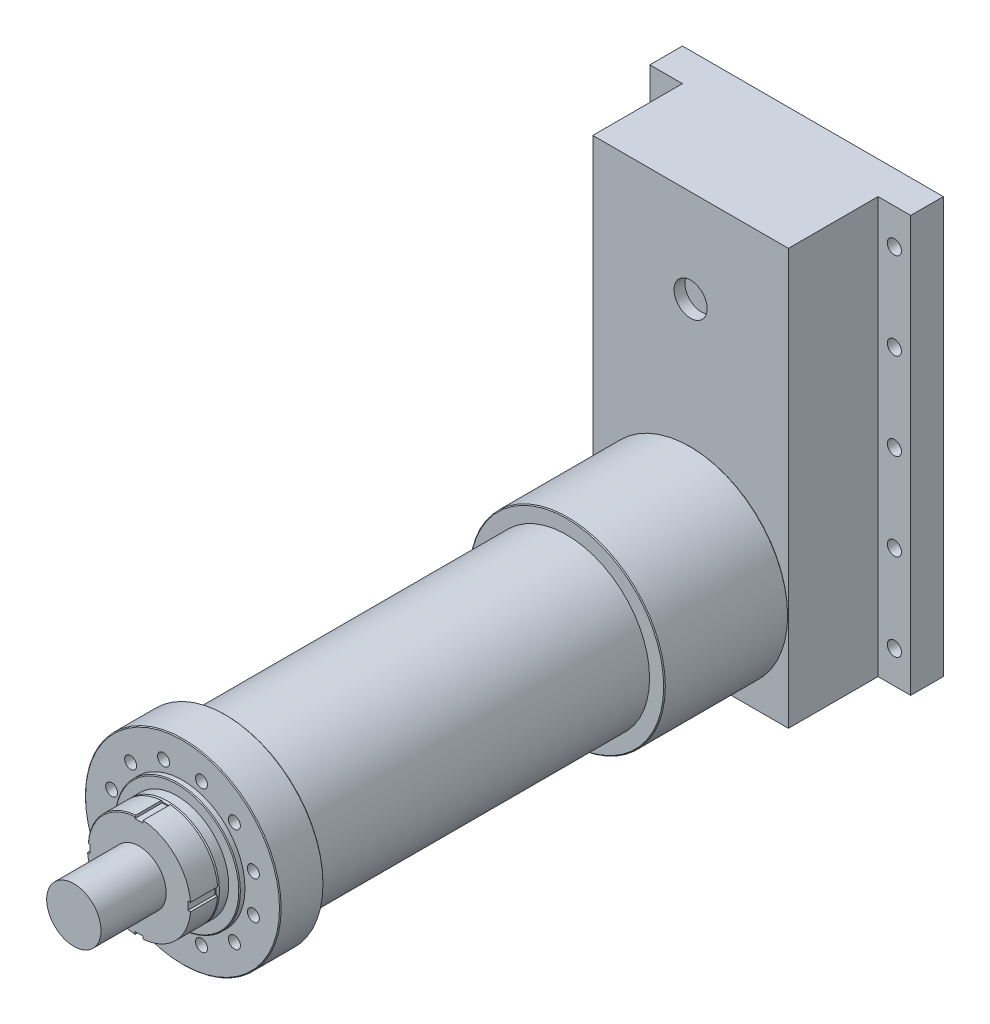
from build123d import *

# Parameters (mm, degrees)
SKETCH_1_R          = 152.5
EXTRUDE_1_DEPTH     = 627
SKETCH_2_R          = 180
SKETCH_2_R_2        = 11
EXTRUDE_2_DEPTH     = 80
SKETCH_3_R          = 115
EXTRUDE_3_DEPTH     = 10
SKETCH_4_R          = 95
EXTRUDE_4_DEPTH     = 20
CHAMFER_1_SIZE      = 3
EXTRUDE_5_DEPTH     = 50
CHAMFER_2_SIZE      = 1.5
EXTRUDE_START       = 228
SKETCH_11_R         = 180
EXTRUDE_10_DEPTH    = 228
CHAMFER_5_SIZE      = 1.5
EXTRUDE_11_DEPTH    = 165
SKETCH_16_R         = 16
CUT_EXTRUDE_4_DEPTH = 2
SKETCH_18_R         = 30.440746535
CUT_EXTRUDE_6_DEPTH = 20
SKETCH_19_R         = 50
EXTRUDE_12_DEPTH    = 120
SKETCH_23_W         = 480
SKETCH_23_H         = 765
SKETCH_23_R         = 13
EXTRUDE_16_DEPTH    = 60


with BuildPart() as part:
    # Sketch 1 → Extrude 1 (new body)
    with BuildSketch(Plane.XY):
        Circle(SKETCH_1_R)
    extrude(amount=EXTRUDE_1_DEPTH)

    # Sketch 2 → Extrude 2 (add)
    with BuildSketch(Plane.XY.offset(627)):
        Circle(SKETCH_2_R)
        with Locations((130.399986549, 34.940571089)):
            Circle(SKETCH_2_R_2, mode=Mode.SUBTRACT)
        with Locations((130.399986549, -34.940571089)):
            Circle(SKETCH_2_R_2, mode=Mode.SUBTRACT)
        with Locations((95.45941546, -95.45941546)):
            Circle(SKETCH_2_R_2, mode=Mode.SUBTRACT)
        with Locations((34.940571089, -130.399986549)):
            Circle(SKETCH_2_R_2, mode=Mode.SUBTRACT)
        with Locations((-34.940571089, -130.399986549)):
            Circle(SKETCH_2_R_2, mode=Mode.SUBTRACT)
        with Locations((-95.45941546, -95.45941546)):
            Circle(SKETCH_2_R_2, mode=Mode.SUBTRACT)
        with Locations((-130.399986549, -34.940571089)):
            Circle(SKETCH_2_R_2, mode=Mode.SUBTRACT)
        with Locations((-130.399986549, 34.940571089)):
            Circle(SKETCH_2_R_2, mode=Mode.SUBTRACT)
        with Locations((-95.45941546, 95.45941546)):
            Circle(SKETCH_2_R_2, mode=Mode.SUBTRACT)
        with Locations((-34.940571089, 130.399986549)):
            Circle(SKETCH_2_R_2, mode=Mode.SUBTRACT)
        with Locations((34.940571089, 130.399986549)):
            Circle(SKETCH_2_R_2, mode=Mode.SUBTRACT)
        with Locations((95.45941546, 95.45941546)):
            Circle(SKETCH_2_R_2, mode=Mode.SUBTRACT)
    extrude(amount=EXTRUDE_2_DEPTH)

    # Sketch 3 → Extrude 3 (add)
    with BuildSketch(Plane.XY.offset(707)):
        Circle(SKETCH_3_R)
    extrude(amount=EXTRUDE_3_DEPTH)

    # Sketch 4 → Extrude 4 (add)
    with BuildSketch(Plane.XY.offset(717)):
        Circle(SKETCH_4_R)
    extrude(amount=EXTRUDE_4_DEPTH)

    # Chamfer 1
    chamfer_1_edges = [part.edges().sort_by_distance(p)[0] for p in [
        (-95, 0, 737),
    ]]
    chamfer(chamfer_1_edges, length=CHAMFER_1_SIZE)

    # Sketch 5 → Extrude 5 (add)
    with BuildSketch(Plane.XY.offset(737)):
        with BuildLine():
            Line((-7.5, 94.703484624), (-7.5, 90))
            Line((-7.5, 90), (7.5, 90))
            Line((7.5, 90), (7.5, 94.703484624))
            ThreePointArc((7.5, 94.703484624), (67.175144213, 67.175144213), (94.703484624, 7.5))
            Line((94.703484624, 7.5), (90, 7.5))
            Line((90, 7.5), (90, -7.5))
            Line((90, -7.5), (94.703484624, -7.5))
            ThreePointArc((94.703484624, -7.5), (67.175144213, -67.175144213), (7.5, -94.703484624))
            Line((7.5, -94.703484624), (7.5, -90))
            Line((7.5, -90), (-7.5, -90))
            Line((-7.5, -90), (-7.5, -94.703484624))
            ThreePointArc((-7.5, -94.703484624), (-67.175144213, -67.175144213), (-94.703484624, -7.5))
            Line((-94.703484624, -7.5), (-90, -7.5))
            Line((-90, -7.5), (-90, 7.5))
            Line((-90, 7.5), (-94.703484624, 7.5))
            ThreePointArc((-94.703484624, 7.5), (-67.175144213, 67.175144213), (-7.5, 94.703484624))
        make_face()
    extrude(amount=EXTRUDE_5_DEPTH)

    # Chamfer 2
    chamfer_2_edges = [part.edges().sort_by_distance(p)[0] for p in [
        (-180, 0, 707),
        (-180, 0, 627),
        (-115, 0, 717),
        (-67.175144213, 67.175144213, 737),
        (-67.175144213, 67.175144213, 787),
    ]]
    chamfer(chamfer_2_edges, length=CHAMFER_2_SIZE)

    # Sketch 11 → Extrude 10 (add)
    with BuildSketch(Plane(origin=(0, 0, 0), x_dir=(-1, 0, 0), z_dir=(0, 0, -1)).offset(EXTRUDE_START)):
        with Locations(Location((0, 0, 0), (0, 0, 180))):
            Circle(SKETCH_11_R)
    extrude(amount=-EXTRUDE_10_DEPTH)

    # Chamfer 5
    chamfer_5_edges = [part.edges().sort_by_distance(p)[0] for p in [
        (-180, 0, 0),
        (-180, 0, -228),
    ]]
    chamfer(chamfer_5_edges, length=CHAMFER_5_SIZE)

    # Sketch 16 → Cut-Extrude 4 (cut)
    with BuildSketch(Plane(origin=(-152.5, 0, 0), x_dir=(0, 0, -1), z_dir=(1, 0, 0))):
        with Locations(Location((-27, 0, 0), (0, 0, 180))):
            Circle(SKETCH_16_R)
        with Locations(Location((-551.5, 0, 0), (0, 0, 180))):
            Circle(SKETCH_16_R)
    extrude(amount=CUT_EXTRUDE_4_DEPTH, mode=Mode.SUBTRACT)

    # Sketch 19 → Extrude 12 (add)
    with BuildSketch(Plane.XY.offset(787)):
        Circle(SKETCH_19_R)
    extrude(amount=EXTRUDE_12_DEPTH)


with BuildPart() as body_2:
    # Sketch 12 → Extrude 11 (new body)
    with BuildSketch(Plane(origin=(0, 0, -228), x_dir=(-1, 0, 0), z_dir=(0, 0, -1))):
        Polygon((180, 585), (71.93747285, 585), (-71.93747285, 585), (-180, 585), (-180, 420), (-180, -87.177978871), (-180, -180), (-87.177978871, -180), (87.177978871, -180), (180, -180), (180, -87.177978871), (180, 420), align=None)
    extrude(amount=EXTRUDE_11_DEPTH)

    # Sketch 18 → Cut-Extrude 6 (cut)
    with BuildSketch(Plane.XY.offset(-228)):
        with Locations((0, 414)):
            Circle(SKETCH_18_R)
    extrude(amount=-CUT_EXTRUDE_6_DEPTH, mode=Mode.SUBTRACT)

    # Sketch 23 → Extrude 16 (add)
    with BuildSketch(Plane(origin=(0, 0, -393), x_dir=(-1, 0, 0), z_dir=(0, 0, -1))):
        with Locations((0, 202.5)):
            Rectangle(SKETCH_23_W, SKETCH_23_H)
        with Locations((-210, 520)):
            Circle(SKETCH_23_R, mode=Mode.SUBTRACT)
        with Locations((-210, 360)):
            Circle(SKETCH_23_R, mode=Mode.SUBTRACT)
        with Locations((-210, 200)):
            Circle(SKETCH_23_R, mode=Mode.SUBTRACT)
        with Locations((-210, 40)):
            Circle(SKETCH_23_R, mode=Mode.SUBTRACT)
        with Locations((-210, -120)):
            Circle(SKETCH_23_R, mode=Mode.SUBTRACT)
        with Locations(Location((210, -120, 0), (0, 0, 180))):
            Circle(SKETCH_23_R, mode=Mode.SUBTRACT)
        with Locations(Location((210, 40, 0), (0, 0, 180))):
            Circle(SKETCH_23_R, mode=Mode.SUBTRACT)
        with Locations(Location((210, 200, 0), (0, 0, 180))):
            Circle(SKETCH_23_R, mode=Mode.SUBTRACT)
        with Locations(Location((210, 360, 0), (0, 0, 180))):
            Circle(SKETCH_23_R, mode=Mode.SUBTRACT)
        with Locations(Location((210, 520, 0), (0, 0, 180))):
            Circle(SKETCH_23_R, mode=Mode.SUBTRACT)
    extrude(amount=EXTRUDE_16_DEPTH)


solid = Compound([part.part, body_2.part])
